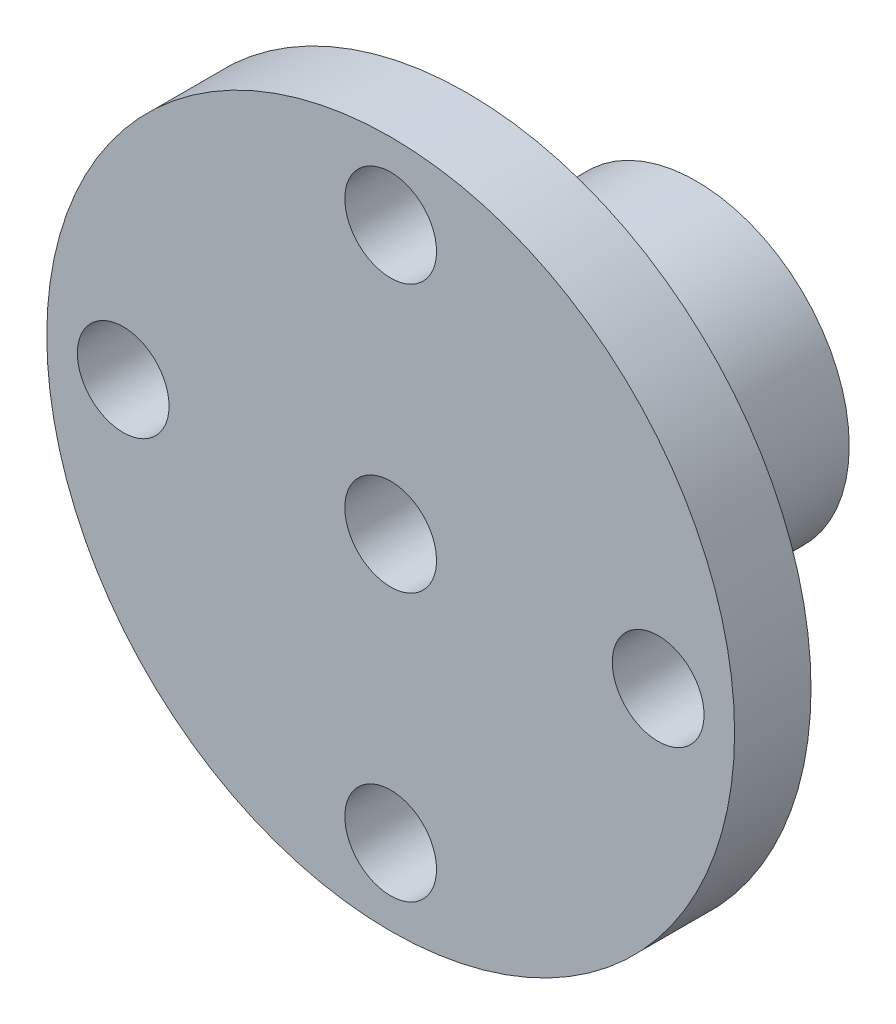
ISO-10303-21;
HEADER;
FILE_DESCRIPTION(('STEP AP214'),'2;1');
FILE_NAME('part.step','',(''),(''),'','','');
FILE_SCHEMA(('AUTOMOTIVE_DESIGN { 1 0 10303 214 1 1 1 1 }'));
ENDSEC;
DATA;
#1=APPLICATION_CONTEXT('core data for automotive mechanical design processes');
#2=APPLICATION_PROTOCOL_DEFINITION('international standard','automotive_design',2000,#1);
#3=PRODUCT_CONTEXT('',#1,'mechanical');
#4=PRODUCT('Part','Part','',(#3));
#5=PRODUCT_RELATED_PRODUCT_CATEGORY('part','',(#4));
#6=PRODUCT_DEFINITION_FORMATION('','',#4);
#7=PRODUCT_DEFINITION_CONTEXT('part definition',#1,'design');
#8=PRODUCT_DEFINITION('design','',#6,#7);
#9=PRODUCT_DEFINITION_SHAPE('','',#8);
#10=(LENGTH_UNIT() NAMED_UNIT(*) SI_UNIT(.MILLI.,.METRE.));
#11=(NAMED_UNIT(*) PLANE_ANGLE_UNIT() SI_UNIT($,.RADIAN.));
#12=(NAMED_UNIT(*) SI_UNIT($,.STERADIAN.) SOLID_ANGLE_UNIT());
#13=UNCERTAINTY_MEASURE_WITH_UNIT(LENGTH_MEASURE(1.E-05),#10,'distance_accuracy_value','');
#14=(GEOMETRIC_REPRESENTATION_CONTEXT(3) GLOBAL_UNCERTAINTY_ASSIGNED_CONTEXT((#13)) GLOBAL_UNIT_ASSIGNED_CONTEXT((#10,
#11,#12)) REPRESENTATION_CONTEXT('',''));
#15=CARTESIAN_POINT('',(0.,0.,0.));
#16=DIRECTION('',(0.,0.,1.));
#17=DIRECTION('',(1.,0.,0.));
#18=AXIS2_PLACEMENT_3D('',#15,#16,#17);
#19=CARTESIAN_POINT('',(0.,0.,5.));
#20=DIRECTION('',(0.,0.,1.));
#21=DIRECTION('',(1.,0.,0.));
#22=AXIS2_PLACEMENT_3D('',#19,#20,#21);
#23=PLANE('',#22);
#24=CARTESIAN_POINT('',(0.,0.,5.));
#25=DIRECTION('',(0.,0.,-1.));
#26=DIRECTION('',(-1.,0.,0.));
#27=AXIS2_PLACEMENT_3D('',#24,#25,#26);
#28=CIRCLE('',#27,3.);
#29=CARTESIAN_POINT('',(-3.,0.,5.));
#30=VERTEX_POINT('',#29);
#31=EDGE_CURVE('E77',#30,#30,#28,.T.);
#32=ORIENTED_EDGE('',*,*,#31,.T.);
#33=EDGE_LOOP('',(#32));
#34=FACE_BOUND('',#33,.T.);
#35=CARTESIAN_POINT('',(0.,-17.5,5.));
#36=DIRECTION('',(0.,0.,1.));
#37=DIRECTION('',(1.,0.,0.));
#38=AXIS2_PLACEMENT_3D('',#35,#36,#37);
#39=CIRCLE('',#38,3.);
#40=CARTESIAN_POINT('',(3.,-17.5,5.));
#41=VERTEX_POINT('',#40);
#42=EDGE_CURVE('E60',#41,#41,#39,.T.);
#43=ORIENTED_EDGE('',*,*,#42,.F.);
#44=EDGE_LOOP('',(#43));
#45=FACE_BOUND('',#44,.T.);
#46=CARTESIAN_POINT('',(0.,17.5066986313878,5.));
#47=DIRECTION('',(0.,0.,1.));
#48=DIRECTION('',(1.,0.,0.));
#49=AXIS2_PLACEMENT_3D('',#46,#47,#48);
#50=CIRCLE('',#49,3.);
#51=CARTESIAN_POINT('',(3.,17.5066986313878,5.));
#52=VERTEX_POINT('',#51);
#53=EDGE_CURVE('E49',#52,#52,#50,.T.);
#54=ORIENTED_EDGE('',*,*,#53,.F.);
#55=EDGE_LOOP('',(#54));
#56=FACE_BOUND('',#55,.T.);
#57=CARTESIAN_POINT('',(0.,0.,5.));
#58=DIRECTION('',(0.,0.,1.));
#59=DIRECTION('',(1.,0.,0.));
#60=AXIS2_PLACEMENT_3D('',#57,#58,#59);
#61=CIRCLE('',#60,22.5);
#62=CARTESIAN_POINT('',(22.5,0.,5.));
#63=VERTEX_POINT('',#62);
#64=EDGE_CURVE('E40',#63,#63,#61,.T.);
#65=ORIENTED_EDGE('',*,*,#64,.T.);
#66=EDGE_LOOP('',(#65));
#67=FACE_BOUND('',#66,.T.);
#68=CARTESIAN_POINT('',(17.5,0.,5.));
#69=DIRECTION('',(0.,0.,1.));
#70=DIRECTION('',(1.,0.,0.));
#71=AXIS2_PLACEMENT_3D('',#68,#69,#70);
#72=CIRCLE('',#71,3.);
#73=CARTESIAN_POINT('',(20.5,0.,5.));
#74=VERTEX_POINT('',#73);
#75=EDGE_CURVE('E54',#74,#74,#72,.T.);
#76=ORIENTED_EDGE('',*,*,#75,.F.);
#77=EDGE_LOOP('',(#76));
#78=FACE_BOUND('',#77,.T.);
#79=CARTESIAN_POINT('',(-17.5,0.,5.));
#80=DIRECTION('',(0.,0.,1.));
#81=DIRECTION('',(1.,0.,0.));
#82=AXIS2_PLACEMENT_3D('',#79,#80,#81);
#83=CIRCLE('',#82,3.);
#84=CARTESIAN_POINT('',(-14.5,0.,5.));
#85=VERTEX_POINT('',#84);
#86=EDGE_CURVE('E66',#85,#85,#83,.T.);
#87=ORIENTED_EDGE('',*,*,#86,.F.);
#88=EDGE_LOOP('',(#87));
#89=FACE_BOUND('',#88,.T.);
#90=ADVANCED_FACE('F33',(#34,#45,#56,#67,#78,#89),#23,.T.);
#91=CARTESIAN_POINT('',(0.,0.,0.));
#92=DIRECTION('',(0.,0.,1.));
#93=DIRECTION('',(1.,0.,0.));
#94=AXIS2_PLACEMENT_3D('',#91,#92,#93);
#95=PLANE('',#94);
#96=CARTESIAN_POINT('',(0.,0.,0.));
#97=DIRECTION('',(0.,0.,1.));
#98=DIRECTION('',(1.,0.,0.));
#99=AXIS2_PLACEMENT_3D('',#96,#97,#98);
#100=CIRCLE('',#99,10.);
#101=CARTESIAN_POINT('',(10.,0.,0.));
#102=VERTEX_POINT('',#101);
#103=EDGE_CURVE('E10',#102,#102,#100,.F.);
#104=ORIENTED_EDGE('',*,*,#103,.F.);
#105=EDGE_LOOP('',(#104));
#106=FACE_BOUND('',#105,.T.);
#107=CARTESIAN_POINT('',(0.,0.,0.));
#108=DIRECTION('',(0.,0.,1.));
#109=DIRECTION('',(1.,0.,0.));
#110=AXIS2_PLACEMENT_3D('',#107,#108,#109);
#111=CIRCLE('',#110,22.5);
#112=CARTESIAN_POINT('',(22.5,0.,0.));
#113=VERTEX_POINT('',#112);
#114=EDGE_CURVE('E44',#113,#113,#111,.T.);
#115=ORIENTED_EDGE('',*,*,#114,.F.);
#116=EDGE_LOOP('',(#115));
#117=FACE_BOUND('',#116,.T.);
#118=CARTESIAN_POINT('',(0.,17.5066986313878,0.));
#119=DIRECTION('',(0.,0.,1.));
#120=DIRECTION('',(1.,0.,0.));
#121=AXIS2_PLACEMENT_3D('',#118,#119,#120);
#122=CIRCLE('',#121,3.);
#123=CARTESIAN_POINT('',(3.,17.5066986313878,0.));
#124=VERTEX_POINT('',#123);
#125=EDGE_CURVE('E51',#124,#124,#122,.T.);
#126=ORIENTED_EDGE('',*,*,#125,.T.);
#127=EDGE_LOOP('',(#126));
#128=FACE_BOUND('',#127,.T.);
#129=CARTESIAN_POINT('',(17.5,0.,0.));
#130=DIRECTION('',(0.,0.,1.));
#131=DIRECTION('',(1.,0.,0.));
#132=AXIS2_PLACEMENT_3D('',#129,#130,#131);
#133=CIRCLE('',#132,3.);
#134=CARTESIAN_POINT('',(20.5,0.,0.));
#135=VERTEX_POINT('',#134);
#136=EDGE_CURVE('E57',#135,#135,#133,.T.);
#137=ORIENTED_EDGE('',*,*,#136,.T.);
#138=EDGE_LOOP('',(#137));
#139=FACE_BOUND('',#138,.T.);
#140=CARTESIAN_POINT('',(0.,-17.5,0.));
#141=DIRECTION('',(0.,0.,1.));
#142=DIRECTION('',(1.,0.,0.));
#143=AXIS2_PLACEMENT_3D('',#140,#141,#142);
#144=CIRCLE('',#143,3.);
#145=CARTESIAN_POINT('',(3.,-17.5,0.));
#146=VERTEX_POINT('',#145);
#147=EDGE_CURVE('E63',#146,#146,#144,.T.);
#148=ORIENTED_EDGE('',*,*,#147,.T.);
#149=EDGE_LOOP('',(#148));
#150=FACE_BOUND('',#149,.T.);
#151=CARTESIAN_POINT('',(-17.5,0.,0.));
#152=DIRECTION('',(0.,0.,1.));
#153=DIRECTION('',(1.,0.,0.));
#154=AXIS2_PLACEMENT_3D('',#151,#152,#153);
#155=CIRCLE('',#154,3.);
#156=CARTESIAN_POINT('',(-14.5,0.,0.));
#157=VERTEX_POINT('',#156);
#158=EDGE_CURVE('E69',#157,#157,#155,.T.);
#159=ORIENTED_EDGE('',*,*,#158,.T.);
#160=EDGE_LOOP('',(#159));
#161=FACE_BOUND('',#160,.T.);
#162=ADVANCED_FACE('F109',(#106,#117,#128,#139,#150,#161),#95,.F.);
#163=CARTESIAN_POINT('',(0.,0.,5.));
#164=DIRECTION('',(0.,0.,-1.));
#165=DIRECTION('',(-1.,0.,0.));
#166=AXIS2_PLACEMENT_3D('',#163,#164,#165);
#167=CYLINDRICAL_SURFACE('',#166,22.5);
#168=ORIENTED_EDGE('',*,*,#64,.F.);
#169=EDGE_LOOP('',(#168));
#170=FACE_BOUND('',#169,.T.);
#171=ORIENTED_EDGE('',*,*,#114,.T.);
#172=EDGE_LOOP('',(#171));
#173=FACE_BOUND('',#172,.T.);
#174=ADVANCED_FACE('F35',(#170,#173),#167,.T.);
#175=CARTESIAN_POINT('',(0.,17.5066986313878,5.));
#176=DIRECTION('',(0.,0.,-1.));
#177=DIRECTION('',(-1.,0.,0.));
#178=AXIS2_PLACEMENT_3D('',#175,#176,#177);
#179=CYLINDRICAL_SURFACE('',#178,3.);
#180=ORIENTED_EDGE('',*,*,#53,.T.);
#181=EDGE_LOOP('',(#180));
#182=FACE_BOUND('',#181,.T.);
#183=ORIENTED_EDGE('',*,*,#125,.F.);
#184=EDGE_LOOP('',(#183));
#185=FACE_BOUND('',#184,.T.);
#186=ADVANCED_FACE('F116',(#182,#185),#179,.F.);
#187=CARTESIAN_POINT('',(17.5,0.,5.));
#188=DIRECTION('',(0.,0.,-1.));
#189=DIRECTION('',(-1.,0.,0.));
#190=AXIS2_PLACEMENT_3D('',#187,#188,#189);
#191=CYLINDRICAL_SURFACE('',#190,3.);
#192=ORIENTED_EDGE('',*,*,#75,.T.);
#193=EDGE_LOOP('',(#192));
#194=FACE_BOUND('',#193,.T.);
#195=ORIENTED_EDGE('',*,*,#136,.F.);
#196=EDGE_LOOP('',(#195));
#197=FACE_BOUND('',#196,.T.);
#198=ADVANCED_FACE('F119',(#194,#197),#191,.F.);
#199=CARTESIAN_POINT('',(0.,-17.5,5.));
#200=DIRECTION('',(0.,0.,-1.));
#201=DIRECTION('',(-1.,0.,0.));
#202=AXIS2_PLACEMENT_3D('',#199,#200,#201);
#203=CYLINDRICAL_SURFACE('',#202,3.);
#204=ORIENTED_EDGE('',*,*,#42,.T.);
#205=EDGE_LOOP('',(#204));
#206=FACE_BOUND('',#205,.T.);
#207=ORIENTED_EDGE('',*,*,#147,.F.);
#208=EDGE_LOOP('',(#207));
#209=FACE_BOUND('',#208,.T.);
#210=ADVANCED_FACE('F105',(#206,#209),#203,.F.);
#211=CARTESIAN_POINT('',(-17.5,0.,5.));
#212=DIRECTION('',(0.,0.,-1.));
#213=DIRECTION('',(-1.,0.,0.));
#214=AXIS2_PLACEMENT_3D('',#211,#212,#213);
#215=CYLINDRICAL_SURFACE('',#214,3.);
#216=ORIENTED_EDGE('',*,*,#86,.T.);
#217=EDGE_LOOP('',(#216));
#218=FACE_BOUND('',#217,.T.);
#219=ORIENTED_EDGE('',*,*,#158,.F.);
#220=EDGE_LOOP('',(#219));
#221=FACE_BOUND('',#220,.T.);
#222=ADVANCED_FACE('F100',(#218,#221),#215,.F.);
#223=CARTESIAN_POINT('',(0.,0.,-15.));
#224=DIRECTION('',(0.,0.,1.));
#225=DIRECTION('',(1.,0.,0.));
#226=AXIS2_PLACEMENT_3D('',#223,#224,#225);
#227=CYLINDRICAL_SURFACE('',#226,10.);
#228=CARTESIAN_POINT('',(0.,0.,-15.));
#229=DIRECTION('',(0.,0.,-1.));
#230=DIRECTION('',(-1.,0.,0.));
#231=AXIS2_PLACEMENT_3D('',#228,#229,#230);
#232=CIRCLE('',#231,10.);
#233=CARTESIAN_POINT('',(-10.,0.,-15.));
#234=VERTEX_POINT('',#233);
#235=EDGE_CURVE('E72',#234,#234,#232,.T.);
#236=ORIENTED_EDGE('',*,*,#235,.F.);
#237=EDGE_LOOP('',(#236));
#238=FACE_BOUND('',#237,.T.);
#239=ORIENTED_EDGE('',*,*,#103,.T.);
#240=EDGE_LOOP('',(#239));
#241=FACE_BOUND('',#240,.T.);
#242=ADVANCED_FACE('F95',(#238,#241),#227,.T.);
#243=CARTESIAN_POINT('',(0.,0.,-15.));
#244=DIRECTION('',(0.,0.,-1.));
#245=DIRECTION('',(-1.,0.,0.));
#246=AXIS2_PLACEMENT_3D('',#243,#244,#245);
#247=PLANE('',#246);
#248=CARTESIAN_POINT('',(0.,0.,-15.));
#249=DIRECTION('',(0.,0.,-1.));
#250=DIRECTION('',(-1.,0.,0.));
#251=AXIS2_PLACEMENT_3D('',#248,#249,#250);
#252=CIRCLE('',#251,3.);
#253=CARTESIAN_POINT('',(-3.,0.,-15.));
#254=VERTEX_POINT('',#253);
#255=EDGE_CURVE('E78',#254,#254,#252,.T.);
#256=ORIENTED_EDGE('',*,*,#255,.F.);
#257=EDGE_LOOP('',(#256));
#258=FACE_BOUND('',#257,.T.);
#259=ORIENTED_EDGE('',*,*,#235,.T.);
#260=EDGE_LOOP('',(#259));
#261=FACE_BOUND('',#260,.T.);
#262=ADVANCED_FACE('F89',(#258,#261),#247,.T.);
#263=CARTESIAN_POINT('',(0.,0.,5.));
#264=DIRECTION('',(0.,0.,-1.));
#265=DIRECTION('',(-1.,0.,0.));
#266=AXIS2_PLACEMENT_3D('',#263,#264,#265);
#267=CYLINDRICAL_SURFACE('',#266,3.);
#268=ORIENTED_EDGE('',*,*,#31,.F.);
#269=EDGE_LOOP('',(#268));
#270=FACE_BOUND('',#269,.T.);
#271=ORIENTED_EDGE('',*,*,#255,.T.);
#272=EDGE_LOOP('',(#271));
#273=FACE_BOUND('',#272,.T.);
#274=ADVANCED_FACE('F86',(#270,#273),#267,.F.);
#275=CLOSED_SHELL('',(#90,#162,#174,#186,#198,#210,#222,#242,#262,#274));
#276=MANIFOLD_SOLID_BREP('B2',#275);
#277=ADVANCED_BREP_SHAPE_REPRESENTATION('',(#18,#276),#14);
#278=SHAPE_DEFINITION_REPRESENTATION(#9,#277);
ENDSEC;
END-ISO-10303-21;
